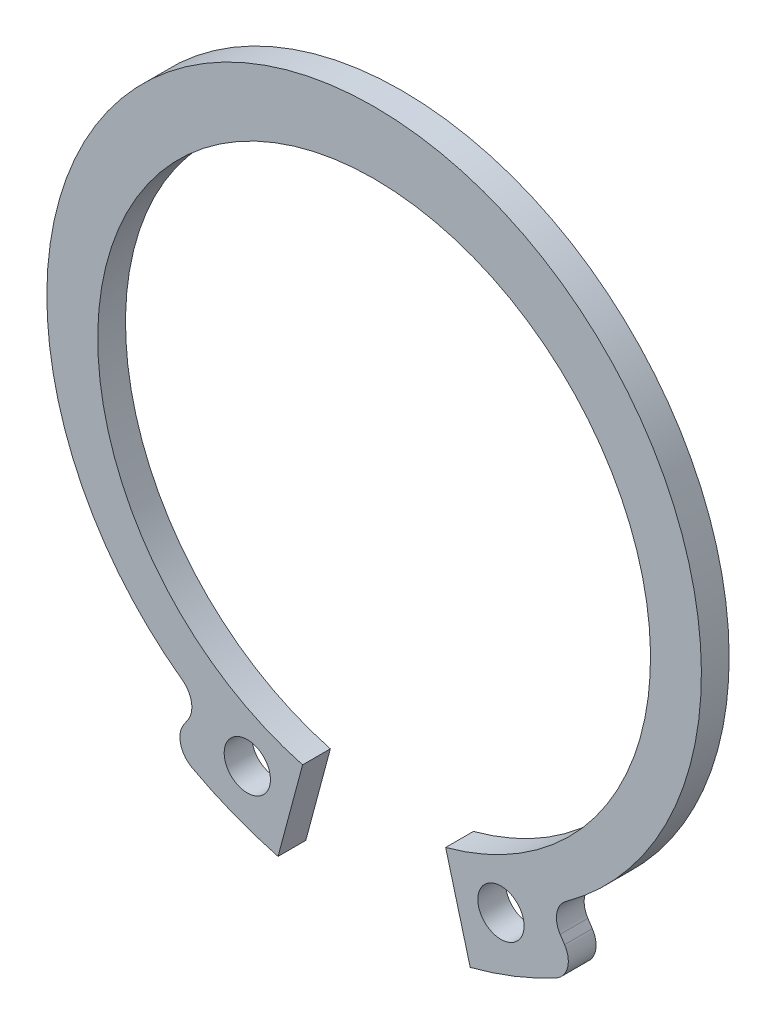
ISO-10303-21;
HEADER;
FILE_DESCRIPTION(('STEP AP214'),'2;1');
FILE_NAME('part.step','',(''),(''),'','','');
FILE_SCHEMA(('AUTOMOTIVE_DESIGN { 1 0 10303 214 1 1 1 1 }'));
ENDSEC;
DATA;
#1=APPLICATION_CONTEXT('core data for automotive mechanical design processes');
#2=APPLICATION_PROTOCOL_DEFINITION('international standard','automotive_design',2000,#1);
#3=PRODUCT_CONTEXT('',#1,'mechanical');
#4=PRODUCT('Part','Part','',(#3));
#5=PRODUCT_RELATED_PRODUCT_CATEGORY('part','',(#4));
#6=PRODUCT_DEFINITION_FORMATION('','',#4);
#7=PRODUCT_DEFINITION_CONTEXT('part definition',#1,'design');
#8=PRODUCT_DEFINITION('design','',#6,#7);
#9=PRODUCT_DEFINITION_SHAPE('','',#8);
#10=(LENGTH_UNIT() NAMED_UNIT(*) SI_UNIT(.MILLI.,.METRE.));
#11=(NAMED_UNIT(*) PLANE_ANGLE_UNIT() SI_UNIT($,.RADIAN.));
#12=(NAMED_UNIT(*) SI_UNIT($,.STERADIAN.) SOLID_ANGLE_UNIT());
#13=UNCERTAINTY_MEASURE_WITH_UNIT(LENGTH_MEASURE(1.E-05),#10,'distance_accuracy_value','');
#14=(GEOMETRIC_REPRESENTATION_CONTEXT(3) GLOBAL_UNCERTAINTY_ASSIGNED_CONTEXT((#13)) GLOBAL_UNIT_ASSIGNED_CONTEXT((#10,
#11,#12)) REPRESENTATION_CONTEXT('',''));
#15=CARTESIAN_POINT('',(0.,0.,0.));
#16=DIRECTION('',(0.,0.,1.));
#17=DIRECTION('',(1.,0.,0.));
#18=AXIS2_PLACEMENT_3D('',#15,#16,#17);
#19=CARTESIAN_POINT('',(-8.88074474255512,-11.7741546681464,1.2));
#20=DIRECTION('',(0.,0.,-1.));
#21=DIRECTION('',(-1.,0.,0.));
#22=AXIS2_PLACEMENT_3D('',#19,#20,#21);
#23=PLANE('',#22);
#24=CARTESIAN_POINT('',(5.48283258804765,-12.7907771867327,1.2));
#25=DIRECTION('',(0.,0.,1.));
#26=DIRECTION('',(1.,0.,0.));
#27=AXIS2_PLACEMENT_3D('',#24,#25,#26);
#28=CIRCLE('',#27,1.);
#29=CARTESIAN_POINT('',(6.48283258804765,-12.7907771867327,1.2));
#30=VERTEX_POINT('',#29);
#31=EDGE_CURVE('E140',#30,#30,#28,.T.);
#32=ORIENTED_EDGE('',*,*,#31,.F.);
#33=EDGE_LOOP('',(#32));
#34=FACE_BOUND('',#33,.T.);
#35=CARTESIAN_POINT('',(-8.88074474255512,-11.7741546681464,1.2));
#36=DIRECTION('',(0.,0.,-1.));
#37=DIRECTION('',(-1.,0.,0.));
#38=AXIS2_PLACEMENT_3D('',#35,#36,#37);
#39=CIRCLE('',#38,1.);
#40=CARTESIAN_POINT('',(-8.29455697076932,-10.9639794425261,1.2));
#41=VERTEX_POINT('',#40);
#42=CARTESIAN_POINT('',(-8.04338537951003,-12.320807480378,1.2));
#43=VERTEX_POINT('',#42);
#44=EDGE_CURVE('E166',#41,#43,#39,.T.);
#45=ORIENTED_EDGE('',*,*,#44,.T.);
#46=DIRECTION('',(-0.546652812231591,-0.837359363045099,0.));
#47=VECTOR('',#46,1.);
#48=CARTESIAN_POINT('',(-8.04338537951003,-12.320807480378,1.2));
#49=LINE('',#48,#47);
#50=CARTESIAN_POINT('',(-8.23396480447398,-12.6127358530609,1.2));
#51=VERTEX_POINT('',#50);
#52=EDGE_CURVE('E135',#43,#51,#49,.T.);
#53=ORIENTED_EDGE('',*,*,#52,.T.);
#54=CARTESIAN_POINT('',(-7.39660544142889,-13.1593886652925,1.2));
#55=DIRECTION('',(0.,0.,1.));
#56=DIRECTION('',(-1.,0.,0.));
#57=AXIS2_PLACEMENT_3D('',#54,#55,#56);
#58=CIRCLE('',#57,1.);
#59=CARTESIAN_POINT('',(-7.87277758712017,-14.0387407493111,1.2));
#60=VERTEX_POINT('',#59);
#61=EDGE_CURVE('E169',#51,#60,#58,.T.);
#62=ORIENTED_EDGE('',*,*,#61,.T.);
#63=CARTESIAN_POINT('',(0.,0.5,1.2));
#64=DIRECTION('',(0.,0.,1.));
#65=DIRECTION('',(1.,0.,0.));
#66=AXIS2_PLACEMENT_3D('',#63,#64,#65);
#67=CIRCLE('',#66,16.5334693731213);
#68=CARTESIAN_POINT('',(-4.15404567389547,-15.5031095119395,1.2));
#69=VERTEX_POINT('',#68);
#70=EDGE_CURVE('E171',#60,#69,#67,.T.);
#71=ORIENTED_EDGE('',*,*,#70,.T.);
#72=DIRECTION('',(0.258819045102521,0.965925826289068,0.));
#73=VECTOR('',#72,1.);
#74=CARTESIAN_POINT('',(-3.09288758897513,-11.5428136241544,1.2));
#75=LINE('',#74,#73);
#76=CARTESIAN_POINT('',(-3.09288758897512,-11.5428136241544,1.2));
#77=VERTEX_POINT('',#76);
#78=EDGE_CURVE('E173',#69,#77,#75,.T.);
#79=ORIENTED_EDGE('',*,*,#78,.T.);
#80=CARTESIAN_POINT('',(0.,0.,1.2));
#81=DIRECTION('',(0.,0.,-1.));
#82=DIRECTION('',(1.,0.,0.));
#83=AXIS2_PLACEMENT_3D('',#80,#81,#82);
#84=CIRCLE('',#83,11.95);
#85=CARTESIAN_POINT('',(3.09288758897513,-11.5428136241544,1.2));
#86=VERTEX_POINT('',#85);
#87=EDGE_CURVE('E175',#77,#86,#84,.T.);
#88=ORIENTED_EDGE('',*,*,#87,.T.);
#89=DIRECTION('',(0.258819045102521,-0.965925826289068,0.));
#90=VECTOR('',#89,1.);
#91=CARTESIAN_POINT('',(3.09288758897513,-11.5428136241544,1.2));
#92=LINE('',#91,#90);
#93=CARTESIAN_POINT('',(4.15404567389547,-15.5031095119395,1.2));
#94=VERTEX_POINT('',#93);
#95=EDGE_CURVE('E177',#86,#94,#92,.T.);
#96=ORIENTED_EDGE('',*,*,#95,.T.);
#97=CARTESIAN_POINT('',(0.,0.5,1.2));
#98=DIRECTION('',(0.,0.,1.));
#99=DIRECTION('',(1.,0.,0.));
#100=AXIS2_PLACEMENT_3D('',#97,#98,#99);
#101=CIRCLE('',#100,16.5334693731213);
#102=CARTESIAN_POINT('',(7.87277758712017,-14.0387407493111,1.2));
#103=VERTEX_POINT('',#102);
#104=EDGE_CURVE('E179',#94,#103,#101,.T.);
#105=ORIENTED_EDGE('',*,*,#104,.T.);
#106=CARTESIAN_POINT('',(7.39660544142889,-13.1593886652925,1.2));
#107=DIRECTION('',(0.,0.,1.));
#108=DIRECTION('',(1.,0.,0.));
#109=AXIS2_PLACEMENT_3D('',#106,#107,#108);
#110=CIRCLE('',#109,1.);
#111=CARTESIAN_POINT('',(8.23396480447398,-12.6127358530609,1.2));
#112=VERTEX_POINT('',#111);
#113=EDGE_CURVE('E181',#103,#112,#110,.T.);
#114=ORIENTED_EDGE('',*,*,#113,.T.);
#115=DIRECTION('',(-0.546652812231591,0.837359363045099,0.));
#116=VECTOR('',#115,1.);
#117=CARTESIAN_POINT('',(8.04338537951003,-12.320807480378,1.2));
#118=LINE('',#117,#116);
#119=CARTESIAN_POINT('',(8.04338537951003,-12.320807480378,1.2));
#120=VERTEX_POINT('',#119);
#121=EDGE_CURVE('E183',#112,#120,#118,.T.);
#122=ORIENTED_EDGE('',*,*,#121,.T.);
#123=CARTESIAN_POINT('',(8.88074474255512,-11.7741546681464,1.2));
#124=DIRECTION('',(0.,0.,-1.));
#125=DIRECTION('',(1.,0.,0.));
#126=AXIS2_PLACEMENT_3D('',#123,#124,#125);
#127=CIRCLE('',#126,1.);
#128=CARTESIAN_POINT('',(8.2945569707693,-10.9639794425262,1.2));
#129=VERTEX_POINT('',#128);
#130=EDGE_CURVE('E52',#120,#129,#127,.T.);
#131=ORIENTED_EDGE('',*,*,#130,.T.);
#132=CARTESIAN_POINT('',(0.,0.5,1.2));
#133=DIRECTION('',(0.,0.,1.));
#134=DIRECTION('',(1.,0.,0.));
#135=AXIS2_PLACEMENT_3D('',#132,#133,#134);
#136=CIRCLE('',#135,14.15);
#137=EDGE_CURVE('E47',#129,#41,#136,.T.);
#138=ORIENTED_EDGE('',*,*,#137,.T.);
#139=EDGE_LOOP('',(#45,#53,#62,#71,#79,#88,#96,#105,#114,#122,#131,#138));
#140=FACE_BOUND('',#139,.T.);
#141=CARTESIAN_POINT('',(-5.48283258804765,-12.7907771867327,1.2));
#142=DIRECTION('',(0.,0.,1.));
#143=DIRECTION('',(-1.,0.,0.));
#144=AXIS2_PLACEMENT_3D('',#141,#142,#143);
#145=CIRCLE('',#144,1.);
#146=CARTESIAN_POINT('',(-6.48283258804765,-12.7907771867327,1.2));
#147=VERTEX_POINT('',#146);
#148=EDGE_CURVE('E286',#147,#147,#145,.T.);
#149=ORIENTED_EDGE('',*,*,#148,.F.);
#150=EDGE_LOOP('',(#149));
#151=FACE_BOUND('',#150,.T.);
#152=ADVANCED_FACE('F32',(#34,#140,#151),#23,.F.);
#153=CARTESIAN_POINT('',(-8.88074474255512,-11.7741546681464,0.));
#154=DIRECTION('',(0.,0.,-1.));
#155=DIRECTION('',(-1.,0.,0.));
#156=AXIS2_PLACEMENT_3D('',#153,#154,#155);
#157=PLANE('',#156);
#158=CARTESIAN_POINT('',(5.48283258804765,-12.7907771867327,0.));
#159=DIRECTION('',(0.,0.,1.));
#160=DIRECTION('',(1.,0.,0.));
#161=AXIS2_PLACEMENT_3D('',#158,#159,#160);
#162=CIRCLE('',#161,1.);
#163=CARTESIAN_POINT('',(6.48283258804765,-12.7907771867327,0.));
#164=VERTEX_POINT('',#163);
#165=EDGE_CURVE('E143',#164,#164,#162,.T.);
#166=ORIENTED_EDGE('',*,*,#165,.T.);
#167=EDGE_LOOP('',(#166));
#168=FACE_BOUND('',#167,.T.);
#169=CARTESIAN_POINT('',(-8.88074474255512,-11.7741546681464,0.));
#170=DIRECTION('',(0.,0.,-1.));
#171=DIRECTION('',(-1.,0.,0.));
#172=AXIS2_PLACEMENT_3D('',#169,#170,#171);
#173=CIRCLE('',#172,1.);
#174=CARTESIAN_POINT('',(-8.29455697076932,-10.9639794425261,0.));
#175=VERTEX_POINT('',#174);
#176=CARTESIAN_POINT('',(-8.04338537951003,-12.320807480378,0.));
#177=VERTEX_POINT('',#176);
#178=EDGE_CURVE('E126',#175,#177,#173,.T.);
#179=ORIENTED_EDGE('',*,*,#178,.F.);
#180=CARTESIAN_POINT('',(0.,0.5,0.));
#181=DIRECTION('',(0.,0.,1.));
#182=DIRECTION('',(1.,0.,0.));
#183=AXIS2_PLACEMENT_3D('',#180,#181,#182);
#184=CIRCLE('',#183,14.15);
#185=CARTESIAN_POINT('',(8.2945569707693,-10.9639794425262,0.));
#186=VERTEX_POINT('',#185);
#187=EDGE_CURVE('E164',#186,#175,#184,.T.);
#188=ORIENTED_EDGE('',*,*,#187,.F.);
#189=CARTESIAN_POINT('',(8.88074474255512,-11.7741546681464,0.));
#190=DIRECTION('',(0.,0.,-1.));
#191=DIRECTION('',(1.,0.,0.));
#192=AXIS2_PLACEMENT_3D('',#189,#190,#191);
#193=CIRCLE('',#192,1.);
#194=CARTESIAN_POINT('',(8.04338537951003,-12.320807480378,0.));
#195=VERTEX_POINT('',#194);
#196=EDGE_CURVE('E162',#195,#186,#193,.T.);
#197=ORIENTED_EDGE('',*,*,#196,.F.);
#198=DIRECTION('',(-0.546652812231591,0.837359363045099,0.));
#199=VECTOR('',#198,1.);
#200=CARTESIAN_POINT('',(8.04338537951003,-12.320807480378,0.));
#201=LINE('',#200,#199);
#202=CARTESIAN_POINT('',(8.23396480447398,-12.6127358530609,0.));
#203=VERTEX_POINT('',#202);
#204=EDGE_CURVE('E160',#203,#195,#201,.T.);
#205=ORIENTED_EDGE('',*,*,#204,.F.);
#206=CARTESIAN_POINT('',(7.39660544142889,-13.1593886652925,0.));
#207=DIRECTION('',(0.,0.,1.));
#208=DIRECTION('',(1.,0.,0.));
#209=AXIS2_PLACEMENT_3D('',#206,#207,#208);
#210=CIRCLE('',#209,1.);
#211=CARTESIAN_POINT('',(7.87277758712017,-14.0387407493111,0.));
#212=VERTEX_POINT('',#211);
#213=EDGE_CURVE('E158',#212,#203,#210,.T.);
#214=ORIENTED_EDGE('',*,*,#213,.F.);
#215=CARTESIAN_POINT('',(0.,0.5,0.));
#216=DIRECTION('',(0.,0.,1.));
#217=DIRECTION('',(1.,0.,0.));
#218=AXIS2_PLACEMENT_3D('',#215,#216,#217);
#219=CIRCLE('',#218,16.5334693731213);
#220=CARTESIAN_POINT('',(4.15404567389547,-15.5031095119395,0.));
#221=VERTEX_POINT('',#220);
#222=EDGE_CURVE('E156',#221,#212,#219,.T.);
#223=ORIENTED_EDGE('',*,*,#222,.F.);
#224=DIRECTION('',(0.258819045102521,-0.965925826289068,0.));
#225=VECTOR('',#224,1.);
#226=CARTESIAN_POINT('',(3.09288758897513,-11.5428136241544,0.));
#227=LINE('',#226,#225);
#228=CARTESIAN_POINT('',(3.09288758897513,-11.5428136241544,0.));
#229=VERTEX_POINT('',#228);
#230=EDGE_CURVE('E154',#229,#221,#227,.T.);
#231=ORIENTED_EDGE('',*,*,#230,.F.);
#232=CARTESIAN_POINT('',(0.,0.,0.));
#233=DIRECTION('',(0.,0.,-1.));
#234=DIRECTION('',(1.,0.,0.));
#235=AXIS2_PLACEMENT_3D('',#232,#233,#234);
#236=CIRCLE('',#235,11.95);
#237=CARTESIAN_POINT('',(-3.09288758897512,-11.5428136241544,0.));
#238=VERTEX_POINT('',#237);
#239=EDGE_CURVE('E152',#238,#229,#236,.T.);
#240=ORIENTED_EDGE('',*,*,#239,.F.);
#241=DIRECTION('',(0.258819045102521,0.965925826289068,0.));
#242=VECTOR('',#241,1.);
#243=CARTESIAN_POINT('',(-3.09288758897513,-11.5428136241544,0.));
#244=LINE('',#243,#242);
#245=CARTESIAN_POINT('',(-4.15404567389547,-15.5031095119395,0.));
#246=VERTEX_POINT('',#245);
#247=EDGE_CURVE('E150',#246,#238,#244,.T.);
#248=ORIENTED_EDGE('',*,*,#247,.F.);
#249=CARTESIAN_POINT('',(0.,0.5,0.));
#250=DIRECTION('',(0.,0.,1.));
#251=DIRECTION('',(1.,0.,0.));
#252=AXIS2_PLACEMENT_3D('',#249,#250,#251);
#253=CIRCLE('',#252,16.5334693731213);
#254=CARTESIAN_POINT('',(-7.87277758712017,-14.0387407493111,0.));
#255=VERTEX_POINT('',#254);
#256=EDGE_CURVE('E148',#255,#246,#253,.T.);
#257=ORIENTED_EDGE('',*,*,#256,.F.);
#258=CARTESIAN_POINT('',(-7.39660544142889,-13.1593886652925,0.));
#259=DIRECTION('',(0.,0.,1.));
#260=DIRECTION('',(-1.,0.,0.));
#261=AXIS2_PLACEMENT_3D('',#258,#259,#260);
#262=CIRCLE('',#261,1.);
#263=CARTESIAN_POINT('',(-8.23396480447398,-12.6127358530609,0.));
#264=VERTEX_POINT('',#263);
#265=EDGE_CURVE('E128',#264,#255,#262,.T.);
#266=ORIENTED_EDGE('',*,*,#265,.F.);
#267=DIRECTION('',(-0.546652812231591,-0.837359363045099,0.));
#268=VECTOR('',#267,1.);
#269=CARTESIAN_POINT('',(-8.04338537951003,-12.320807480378,0.));
#270=LINE('',#269,#268);
#271=EDGE_CURVE('E121',#177,#264,#270,.T.);
#272=ORIENTED_EDGE('',*,*,#271,.F.);
#273=EDGE_LOOP('',(#179,#188,#197,#205,#214,#223,#231,#240,#248,#257,#266,#272));
#274=FACE_BOUND('',#273,.T.);
#275=CARTESIAN_POINT('',(-5.48283258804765,-12.7907771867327,0.));
#276=DIRECTION('',(0.,0.,1.));
#277=DIRECTION('',(-1.,0.,0.));
#278=AXIS2_PLACEMENT_3D('',#275,#276,#277);
#279=CIRCLE('',#278,1.);
#280=CARTESIAN_POINT('',(-6.48283258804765,-12.7907771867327,0.));
#281=VERTEX_POINT('',#280);
#282=EDGE_CURVE('E289',#281,#281,#279,.T.);
#283=ORIENTED_EDGE('',*,*,#282,.T.);
#284=EDGE_LOOP('',(#283));
#285=FACE_BOUND('',#284,.T.);
#286=ADVANCED_FACE('F122',(#168,#274,#285),#157,.T.);
#287=CARTESIAN_POINT('',(-8.88074474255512,-11.7741546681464,1.2));
#288=DIRECTION('',(0.,0.,-1.));
#289=DIRECTION('',(-1.,0.,0.));
#290=AXIS2_PLACEMENT_3D('',#287,#288,#289);
#291=CYLINDRICAL_SURFACE('',#290,1.);
#292=ORIENTED_EDGE('',*,*,#178,.T.);
#293=DIRECTION('',(0.,0.,-1.));
#294=VECTOR('',#293,1.);
#295=CARTESIAN_POINT('',(-8.04338537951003,-12.320807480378,1.2));
#296=LINE('',#295,#294);
#297=EDGE_CURVE('E11',#43,#177,#296,.T.);
#298=ORIENTED_EDGE('',*,*,#297,.F.);
#299=ORIENTED_EDGE('',*,*,#44,.F.);
#300=DIRECTION('',(0.,0.,-1.));
#301=VECTOR('',#300,1.);
#302=CARTESIAN_POINT('',(-8.29455697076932,-10.9639794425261,1.2));
#303=LINE('',#302,#301);
#304=EDGE_CURVE('E139',#41,#175,#303,.T.);
#305=ORIENTED_EDGE('',*,*,#304,.T.);
#306=EDGE_LOOP('',(#292,#298,#299,#305));
#307=FACE_BOUND('',#306,.T.);
#308=ADVANCED_FACE('F34',(#307),#291,.F.);
#309=CARTESIAN_POINT('',(-8.04338537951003,-12.320807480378,1.2));
#310=DIRECTION('',(0.837359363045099,-0.546652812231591,0.));
#311=DIRECTION('',(0.546652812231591,0.837359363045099,0.));
#312=AXIS2_PLACEMENT_3D('',#309,#310,#311);
#313=PLANE('',#312);
#314=ORIENTED_EDGE('',*,*,#271,.T.);
#315=DIRECTION('',(0.,0.,-1.));
#316=VECTOR('',#315,1.);
#317=CARTESIAN_POINT('',(-8.23396480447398,-12.6127358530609,1.2));
#318=LINE('',#317,#316);
#319=EDGE_CURVE('E40',#51,#264,#318,.T.);
#320=ORIENTED_EDGE('',*,*,#319,.F.);
#321=ORIENTED_EDGE('',*,*,#52,.F.);
#322=ORIENTED_EDGE('',*,*,#297,.T.);
#323=EDGE_LOOP('',(#314,#320,#321,#322));
#324=FACE_BOUND('',#323,.T.);
#325=ADVANCED_FACE('F134',(#324),#313,.F.);
#326=CARTESIAN_POINT('',(-7.39660544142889,-13.1593886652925,1.2));
#327=DIRECTION('',(0.,0.,-1.));
#328=DIRECTION('',(-1.,0.,0.));
#329=AXIS2_PLACEMENT_3D('',#326,#327,#328);
#330=CYLINDRICAL_SURFACE('',#329,1.);
#331=ORIENTED_EDGE('',*,*,#265,.T.);
#332=DIRECTION('',(0.,0.,-1.));
#333=VECTOR('',#332,1.);
#334=CARTESIAN_POINT('',(-7.87277758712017,-14.0387407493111,1.2));
#335=LINE('',#334,#333);
#336=EDGE_CURVE('E212',#60,#255,#335,.T.);
#337=ORIENTED_EDGE('',*,*,#336,.F.);
#338=ORIENTED_EDGE('',*,*,#61,.F.);
#339=ORIENTED_EDGE('',*,*,#319,.T.);
#340=EDGE_LOOP('',(#331,#337,#338,#339));
#341=FACE_BOUND('',#340,.T.);
#342=ADVANCED_FACE('F216',(#341),#330,.T.);
#343=CARTESIAN_POINT('',(0.,0.5,1.2));
#344=DIRECTION('',(0.,0.,-1.));
#345=DIRECTION('',(-1.,0.,0.));
#346=AXIS2_PLACEMENT_3D('',#343,#344,#345);
#347=CYLINDRICAL_SURFACE('',#346,16.5334693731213);
#348=ORIENTED_EDGE('',*,*,#256,.T.);
#349=DIRECTION('',(0.,0.,-1.));
#350=VECTOR('',#349,1.);
#351=CARTESIAN_POINT('',(-4.15404567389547,-15.5031095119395,1.2));
#352=LINE('',#351,#350);
#353=EDGE_CURVE('E209',#69,#246,#352,.T.);
#354=ORIENTED_EDGE('',*,*,#353,.F.);
#355=ORIENTED_EDGE('',*,*,#70,.F.);
#356=ORIENTED_EDGE('',*,*,#336,.T.);
#357=EDGE_LOOP('',(#348,#354,#355,#356));
#358=FACE_BOUND('',#357,.T.);
#359=ADVANCED_FACE('F224',(#358),#347,.T.);
#360=CARTESIAN_POINT('',(-3.09288758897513,-11.5428136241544,1.2));
#361=DIRECTION('',(-0.965925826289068,0.258819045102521,0.));
#362=DIRECTION('',(-0.258819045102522,-0.965925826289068,0.));
#363=AXIS2_PLACEMENT_3D('',#360,#361,#362);
#364=PLANE('',#363);
#365=ORIENTED_EDGE('',*,*,#247,.T.);
#366=DIRECTION('',(0.,0.,-1.));
#367=VECTOR('',#366,1.);
#368=CARTESIAN_POINT('',(-3.09288758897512,-11.5428136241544,1.2));
#369=LINE('',#368,#367);
#370=EDGE_CURVE('E206',#77,#238,#369,.T.);
#371=ORIENTED_EDGE('',*,*,#370,.F.);
#372=ORIENTED_EDGE('',*,*,#78,.F.);
#373=ORIENTED_EDGE('',*,*,#353,.T.);
#374=EDGE_LOOP('',(#365,#371,#372,#373));
#375=FACE_BOUND('',#374,.T.);
#376=ADVANCED_FACE('F227',(#375),#364,.F.);
#377=CARTESIAN_POINT('',(0.,0.,1.2));
#378=DIRECTION('',(0.,0.,-1.));
#379=DIRECTION('',(-1.,0.,0.));
#380=AXIS2_PLACEMENT_3D('',#377,#378,#379);
#381=CYLINDRICAL_SURFACE('',#380,11.95);
#382=ORIENTED_EDGE('',*,*,#239,.T.);
#383=DIRECTION('',(0.,0.,-1.));
#384=VECTOR('',#383,1.);
#385=CARTESIAN_POINT('',(3.09288758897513,-11.5428136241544,1.2));
#386=LINE('',#385,#384);
#387=EDGE_CURVE('E203',#86,#229,#386,.T.);
#388=ORIENTED_EDGE('',*,*,#387,.F.);
#389=ORIENTED_EDGE('',*,*,#87,.F.);
#390=ORIENTED_EDGE('',*,*,#370,.T.);
#391=EDGE_LOOP('',(#382,#388,#389,#390));
#392=FACE_BOUND('',#391,.T.);
#393=ADVANCED_FACE('F232',(#392),#381,.F.);
#394=CARTESIAN_POINT('',(3.09288758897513,-11.5428136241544,1.2));
#395=DIRECTION('',(0.965925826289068,0.258819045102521,0.));
#396=DIRECTION('',(-0.258819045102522,0.965925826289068,0.));
#397=AXIS2_PLACEMENT_3D('',#394,#395,#396);
#398=PLANE('',#397);
#399=ORIENTED_EDGE('',*,*,#230,.T.);
#400=DIRECTION('',(0.,0.,-1.));
#401=VECTOR('',#400,1.);
#402=CARTESIAN_POINT('',(4.15404567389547,-15.5031095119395,1.2));
#403=LINE('',#402,#401);
#404=EDGE_CURVE('E200',#94,#221,#403,.T.);
#405=ORIENTED_EDGE('',*,*,#404,.F.);
#406=ORIENTED_EDGE('',*,*,#95,.F.);
#407=ORIENTED_EDGE('',*,*,#387,.T.);
#408=EDGE_LOOP('',(#399,#405,#406,#407));
#409=FACE_BOUND('',#408,.T.);
#410=ADVANCED_FACE('F238',(#409),#398,.F.);
#411=CARTESIAN_POINT('',(0.,0.5,1.2));
#412=DIRECTION('',(0.,0.,-1.));
#413=DIRECTION('',(-1.,0.,0.));
#414=AXIS2_PLACEMENT_3D('',#411,#412,#413);
#415=CYLINDRICAL_SURFACE('',#414,16.5334693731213);
#416=ORIENTED_EDGE('',*,*,#222,.T.);
#417=DIRECTION('',(0.,0.,-1.));
#418=VECTOR('',#417,1.);
#419=CARTESIAN_POINT('',(7.87277758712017,-14.0387407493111,1.2));
#420=LINE('',#419,#418);
#421=EDGE_CURVE('E197',#103,#212,#420,.T.);
#422=ORIENTED_EDGE('',*,*,#421,.F.);
#423=ORIENTED_EDGE('',*,*,#104,.F.);
#424=ORIENTED_EDGE('',*,*,#404,.T.);
#425=EDGE_LOOP('',(#416,#422,#423,#424));
#426=FACE_BOUND('',#425,.T.);
#427=ADVANCED_FACE('F242',(#426),#415,.T.);
#428=CARTESIAN_POINT('',(7.39660544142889,-13.1593886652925,1.2));
#429=DIRECTION('',(0.,0.,-1.));
#430=DIRECTION('',(-1.,0.,0.));
#431=AXIS2_PLACEMENT_3D('',#428,#429,#430);
#432=CYLINDRICAL_SURFACE('',#431,1.);
#433=ORIENTED_EDGE('',*,*,#213,.T.);
#434=DIRECTION('',(0.,0.,-1.));
#435=VECTOR('',#434,1.);
#436=CARTESIAN_POINT('',(8.23396480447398,-12.6127358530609,1.2));
#437=LINE('',#436,#435);
#438=EDGE_CURVE('E194',#112,#203,#437,.T.);
#439=ORIENTED_EDGE('',*,*,#438,.F.);
#440=ORIENTED_EDGE('',*,*,#113,.F.);
#441=ORIENTED_EDGE('',*,*,#421,.T.);
#442=EDGE_LOOP('',(#433,#439,#440,#441));
#443=FACE_BOUND('',#442,.T.);
#444=ADVANCED_FACE('F247',(#443),#432,.T.);
#445=CARTESIAN_POINT('',(8.04338537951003,-12.320807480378,1.2));
#446=DIRECTION('',(-0.837359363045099,-0.546652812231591,0.));
#447=DIRECTION('',(0.546652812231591,-0.837359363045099,0.));
#448=AXIS2_PLACEMENT_3D('',#445,#446,#447);
#449=PLANE('',#448);
#450=ORIENTED_EDGE('',*,*,#204,.T.);
#451=DIRECTION('',(0.,0.,-1.));
#452=VECTOR('',#451,1.);
#453=CARTESIAN_POINT('',(8.04338537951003,-12.320807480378,1.2));
#454=LINE('',#453,#452);
#455=EDGE_CURVE('E191',#120,#195,#454,.T.);
#456=ORIENTED_EDGE('',*,*,#455,.F.);
#457=ORIENTED_EDGE('',*,*,#121,.F.);
#458=ORIENTED_EDGE('',*,*,#438,.T.);
#459=EDGE_LOOP('',(#450,#456,#457,#458));
#460=FACE_BOUND('',#459,.T.);
#461=ADVANCED_FACE('F251',(#460),#449,.F.);
#462=CARTESIAN_POINT('',(8.88074474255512,-11.7741546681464,1.2));
#463=DIRECTION('',(0.,0.,-1.));
#464=DIRECTION('',(-1.,0.,0.));
#465=AXIS2_PLACEMENT_3D('',#462,#463,#464);
#466=CYLINDRICAL_SURFACE('',#465,1.);
#467=ORIENTED_EDGE('',*,*,#196,.T.);
#468=DIRECTION('',(0.,0.,-1.));
#469=VECTOR('',#468,1.);
#470=CARTESIAN_POINT('',(8.2945569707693,-10.9639794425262,1.2));
#471=LINE('',#470,#469);
#472=EDGE_CURVE('E188',#129,#186,#471,.T.);
#473=ORIENTED_EDGE('',*,*,#472,.F.);
#474=ORIENTED_EDGE('',*,*,#130,.F.);
#475=ORIENTED_EDGE('',*,*,#455,.T.);
#476=EDGE_LOOP('',(#467,#473,#474,#475));
#477=FACE_BOUND('',#476,.T.);
#478=ADVANCED_FACE('F255',(#477),#466,.F.);
#479=CARTESIAN_POINT('',(0.,0.5,1.2));
#480=DIRECTION('',(0.,0.,-1.));
#481=DIRECTION('',(-1.,0.,0.));
#482=AXIS2_PLACEMENT_3D('',#479,#480,#481);
#483=CYLINDRICAL_SURFACE('',#482,14.15);
#484=ORIENTED_EDGE('',*,*,#187,.T.);
#485=ORIENTED_EDGE('',*,*,#304,.F.);
#486=ORIENTED_EDGE('',*,*,#137,.F.);
#487=ORIENTED_EDGE('',*,*,#472,.T.);
#488=EDGE_LOOP('',(#484,#485,#486,#487));
#489=FACE_BOUND('',#488,.T.);
#490=ADVANCED_FACE('F257',(#489),#483,.T.);
#491=CARTESIAN_POINT('',(5.48283258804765,-12.7907771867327,1.2));
#492=DIRECTION('',(0.,0.,-1.));
#493=DIRECTION('',(-1.,0.,0.));
#494=AXIS2_PLACEMENT_3D('',#491,#492,#493);
#495=CYLINDRICAL_SURFACE('',#494,1.);
#496=ORIENTED_EDGE('',*,*,#31,.T.);
#497=EDGE_LOOP('',(#496));
#498=FACE_BOUND('',#497,.T.);
#499=ORIENTED_EDGE('',*,*,#165,.F.);
#500=EDGE_LOOP('',(#499));
#501=FACE_BOUND('',#500,.T.);
#502=ADVANCED_FACE('F259',(#498,#501),#495,.F.);
#503=CARTESIAN_POINT('',(-5.48283258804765,-12.7907771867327,1.2));
#504=DIRECTION('',(0.,0.,-1.));
#505=DIRECTION('',(-1.,0.,0.));
#506=AXIS2_PLACEMENT_3D('',#503,#504,#505);
#507=CYLINDRICAL_SURFACE('',#506,1.);
#508=ORIENTED_EDGE('',*,*,#148,.T.);
#509=EDGE_LOOP('',(#508));
#510=FACE_BOUND('',#509,.T.);
#511=ORIENTED_EDGE('',*,*,#282,.F.);
#512=EDGE_LOOP('',(#511));
#513=FACE_BOUND('',#512,.T.);
#514=ADVANCED_FACE('F265',(#510,#513),#507,.F.);
#515=CLOSED_SHELL('',(#152,#286,#308,#325,#342,#359,#376,#393,#410,#427,#444,#461,#478,#490,
#502,#514));
#516=MANIFOLD_SOLID_BREP('B2',#515);
#517=ADVANCED_BREP_SHAPE_REPRESENTATION('',(#18,#516),#14);
#518=SHAPE_DEFINITION_REPRESENTATION(#9,#517);
ENDSEC;
END-ISO-10303-21;
